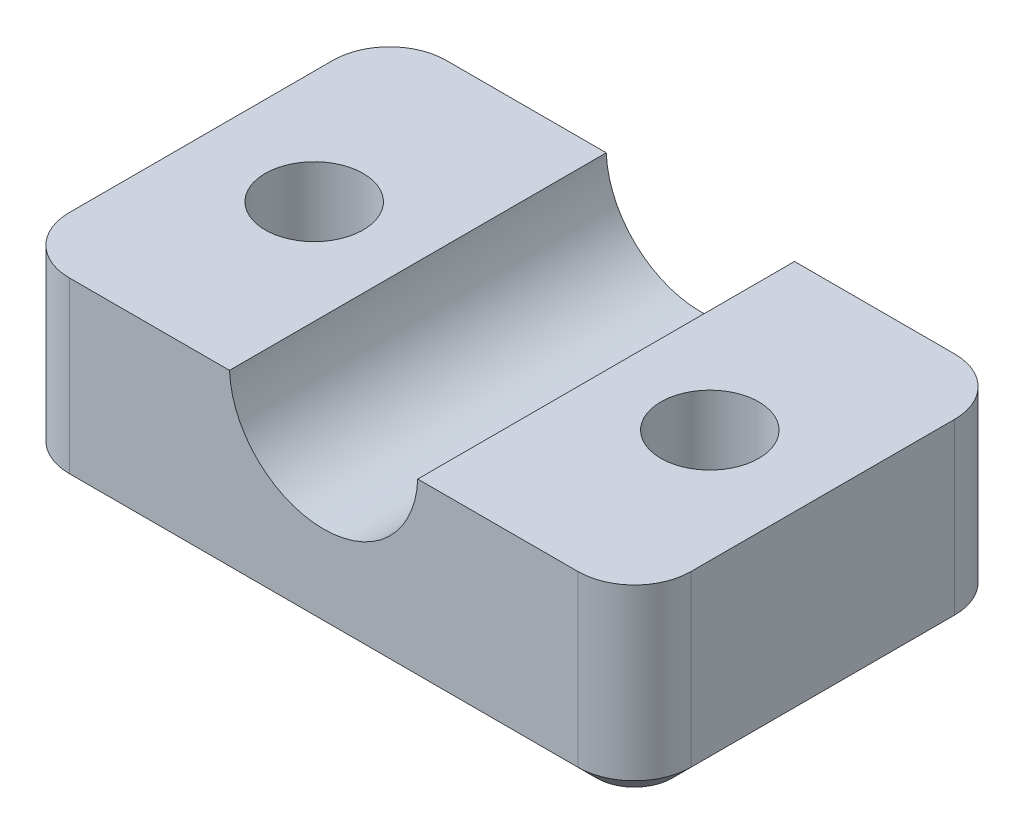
ISO-10303-21;
HEADER;
FILE_DESCRIPTION(('STEP AP214'),'2;1');
FILE_NAME('part.step','',(''),(''),'','','');
FILE_SCHEMA(('AUTOMOTIVE_DESIGN { 1 0 10303 214 1 1 1 1 }'));
ENDSEC;
DATA;
#1=APPLICATION_CONTEXT('core data for automotive mechanical design processes');
#2=APPLICATION_PROTOCOL_DEFINITION('international standard','automotive_design',2000,#1);
#3=PRODUCT_CONTEXT('',#1,'mechanical');
#4=PRODUCT('Part','Part','',(#3));
#5=PRODUCT_RELATED_PRODUCT_CATEGORY('part','',(#4));
#6=PRODUCT_DEFINITION_FORMATION('','',#4);
#7=PRODUCT_DEFINITION_CONTEXT('part definition',#1,'design');
#8=PRODUCT_DEFINITION('design','',#6,#7);
#9=PRODUCT_DEFINITION_SHAPE('','',#8);
#10=(LENGTH_UNIT() NAMED_UNIT(*) SI_UNIT(.MILLI.,.METRE.));
#11=(NAMED_UNIT(*) PLANE_ANGLE_UNIT() SI_UNIT($,.RADIAN.));
#12=(NAMED_UNIT(*) SI_UNIT($,.STERADIAN.) SOLID_ANGLE_UNIT());
#13=UNCERTAINTY_MEASURE_WITH_UNIT(LENGTH_MEASURE(1.E-05),#10,'distance_accuracy_value','');
#14=(GEOMETRIC_REPRESENTATION_CONTEXT(3) GLOBAL_UNCERTAINTY_ASSIGNED_CONTEXT((#13)) GLOBAL_UNIT_ASSIGNED_CONTEXT((#10,
#11,#12)) REPRESENTATION_CONTEXT('',''));
#15=CARTESIAN_POINT('',(0.,0.,0.));
#16=DIRECTION('',(0.,0.,1.));
#17=DIRECTION('',(1.,0.,0.));
#18=AXIS2_PLACEMENT_3D('',#15,#16,#17);
#19=CARTESIAN_POINT('',(-13.5,10.,7.));
#20=DIRECTION('',(0.,1.,0.));
#21=DIRECTION('',(0.,0.,1.));
#22=AXIS2_PLACEMENT_3D('',#19,#20,#21);
#23=PLANE('',#22);
#24=DIRECTION('',(0.,0.,-1.));
#25=VECTOR('',#24,1.);
#26=CARTESIAN_POINT('',(4.99599839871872,10.,24.142135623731));
#27=LINE('',#26,#25);
#28=CARTESIAN_POINT('',(4.99599839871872,10.,10.));
#29=VERTEX_POINT('',#28);
#30=CARTESIAN_POINT('',(4.99599839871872,10.,-10.));
#31=VERTEX_POINT('',#30);
#32=EDGE_CURVE('E146',#29,#31,#27,.T.);
#33=ORIENTED_EDGE('',*,*,#32,.F.);
#34=DIRECTION('',(1.,0.,0.));
#35=VECTOR('',#34,1.);
#36=CARTESIAN_POINT('',(-13.5,10.,10.));
#37=LINE('',#36,#35);
#38=CARTESIAN_POINT('',(13.5,10.,10.));
#39=VERTEX_POINT('',#38);
#40=EDGE_CURVE('E152',#29,#39,#37,.T.);
#41=ORIENTED_EDGE('',*,*,#40,.T.);
#42=CARTESIAN_POINT('',(13.5,10.,7.));
#43=DIRECTION('',(0.,1.,0.));
#44=DIRECTION('',(0.,0.,1.));
#45=AXIS2_PLACEMENT_3D('',#42,#43,#44);
#46=CIRCLE('',#45,3.);
#47=CARTESIAN_POINT('',(16.5,10.,7.));
#48=VERTEX_POINT('',#47);
#49=EDGE_CURVE('E159',#39,#48,#46,.T.);
#50=ORIENTED_EDGE('',*,*,#49,.T.);
#51=DIRECTION('',(0.,0.,-1.));
#52=VECTOR('',#51,1.);
#53=CARTESIAN_POINT('',(16.5,10.,7.));
#54=LINE('',#53,#52);
#55=CARTESIAN_POINT('',(16.5,10.,-7.));
#56=VERTEX_POINT('',#55);
#57=EDGE_CURVE('E161',#48,#56,#54,.T.);
#58=ORIENTED_EDGE('',*,*,#57,.T.);
#59=CARTESIAN_POINT('',(13.5,10.,-7.));
#60=DIRECTION('',(0.,1.,0.));
#61=DIRECTION('',(0.,0.,1.));
#62=AXIS2_PLACEMENT_3D('',#59,#60,#61);
#63=CIRCLE('',#62,3.);
#64=CARTESIAN_POINT('',(13.5,10.,-10.));
#65=VERTEX_POINT('',#64);
#66=EDGE_CURVE('E167',#56,#65,#63,.T.);
#67=ORIENTED_EDGE('',*,*,#66,.T.);
#68=DIRECTION('',(-1.,0.,0.));
#69=VECTOR('',#68,1.);
#70=CARTESIAN_POINT('',(-13.5,10.,-10.));
#71=LINE('',#70,#69);
#72=EDGE_CURVE('E170',#65,#31,#71,.T.);
#73=ORIENTED_EDGE('',*,*,#72,.T.);
#74=EDGE_LOOP('',(#33,#41,#50,#58,#67,#73));
#75=FACE_BOUND('',#74,.T.);
#76=CARTESIAN_POINT('',(10.5,10.,0.));
#77=DIRECTION('',(0.,1.,0.));
#78=DIRECTION('',(0.,0.,1.));
#79=AXIS2_PLACEMENT_3D('',#76,#77,#78);
#80=CIRCLE('',#79,2.6);
#81=CARTESIAN_POINT('',(10.5,10.,2.6));
#82=VERTEX_POINT('',#81);
#83=EDGE_CURVE('E263',#82,#82,#80,.T.);
#84=ORIENTED_EDGE('',*,*,#83,.F.);
#85=EDGE_LOOP('',(#84));
#86=FACE_BOUND('',#85,.T.);
#87=ADVANCED_FACE('F33',(#75,#86),#23,.T.);
#88=DIRECTION('',(0.,0.,-1.));
#89=VECTOR('',#88,1.);
#90=CARTESIAN_POINT('',(-4.99599839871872,10.,24.142135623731));
#91=LINE('',#90,#89);
#92=CARTESIAN_POINT('',(-4.99599839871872,10.,-10.));
#93=VERTEX_POINT('',#92);
#94=CARTESIAN_POINT('',(-4.99599839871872,10.,10.));
#95=VERTEX_POINT('',#94);
#96=EDGE_CURVE('E136',#93,#95,#91,.F.);
#97=ORIENTED_EDGE('',*,*,#96,.F.);
#98=CARTESIAN_POINT('',(-13.5,10.,-10.));
#99=VERTEX_POINT('',#98);
#100=EDGE_CURVE('E169',#93,#99,#71,.T.);
#101=ORIENTED_EDGE('',*,*,#100,.T.);
#102=CARTESIAN_POINT('',(-13.5,10.,-7.));
#103=DIRECTION('',(0.,1.,0.));
#104=DIRECTION('',(0.,0.,1.));
#105=AXIS2_PLACEMENT_3D('',#102,#103,#104);
#106=CIRCLE('',#105,3.);
#107=CARTESIAN_POINT('',(-16.5,10.,-7.));
#108=VERTEX_POINT('',#107);
#109=EDGE_CURVE('E173',#99,#108,#106,.T.);
#110=ORIENTED_EDGE('',*,*,#109,.T.);
#111=DIRECTION('',(0.,0.,1.));
#112=VECTOR('',#111,1.);
#113=CARTESIAN_POINT('',(-16.5,10.,7.));
#114=LINE('',#113,#112);
#115=CARTESIAN_POINT('',(-16.5,10.,7.));
#116=VERTEX_POINT('',#115);
#117=EDGE_CURVE('E175',#108,#116,#114,.T.);
#118=ORIENTED_EDGE('',*,*,#117,.T.);
#119=CARTESIAN_POINT('',(-13.5,10.,7.));
#120=DIRECTION('',(0.,1.,0.));
#121=DIRECTION('',(0.,0.,1.));
#122=AXIS2_PLACEMENT_3D('',#119,#120,#121);
#123=CIRCLE('',#122,3.);
#124=CARTESIAN_POINT('',(-13.5,10.,10.));
#125=VERTEX_POINT('',#124);
#126=EDGE_CURVE('E157',#116,#125,#123,.T.);
#127=ORIENTED_EDGE('',*,*,#126,.T.);
#128=EDGE_CURVE('E150',#125,#95,#37,.T.);
#129=ORIENTED_EDGE('',*,*,#128,.T.);
#130=EDGE_LOOP('',(#97,#101,#110,#118,#127,#129));
#131=FACE_BOUND('',#130,.T.);
#132=CARTESIAN_POINT('',(-10.5,10.,0.));
#133=DIRECTION('',(0.,1.,0.));
#134=DIRECTION('',(0.,0.,-1.));
#135=AXIS2_PLACEMENT_3D('',#132,#133,#134);
#136=CIRCLE('',#135,2.6);
#137=CARTESIAN_POINT('',(-10.5,10.,-2.6));
#138=VERTEX_POINT('',#137);
#139=EDGE_CURVE('E257',#138,#138,#136,.T.);
#140=ORIENTED_EDGE('',*,*,#139,.F.);
#141=EDGE_LOOP('',(#140));
#142=FACE_BOUND('',#141,.T.);
#143=ADVANCED_FACE('F154',(#131,#142),#23,.T.);
#144=CARTESIAN_POINT('',(-13.5,0.,7.));
#145=DIRECTION('',(0.,1.,0.));
#146=DIRECTION('',(0.,0.,1.));
#147=AXIS2_PLACEMENT_3D('',#144,#145,#146);
#148=PLANE('',#147);
#149=DIRECTION('',(0.,0.,-1.));
#150=VECTOR('',#149,1.);
#151=CARTESIAN_POINT('',(-15.5,0.,7.));
#152=LINE('',#151,#150);
#153=CARTESIAN_POINT('',(-15.5,0.,7.));
#154=VERTEX_POINT('',#153);
#155=CARTESIAN_POINT('',(-15.5,0.,-7.));
#156=VERTEX_POINT('',#155);
#157=EDGE_CURVE('E213',#154,#156,#152,.T.);
#158=ORIENTED_EDGE('',*,*,#157,.T.);
#159=CARTESIAN_POINT('',(-13.5,0.,-7.));
#160=DIRECTION('',(0.,1.,0.));
#161=DIRECTION('',(0.,0.,1.));
#162=AXIS2_PLACEMENT_3D('',#159,#160,#161);
#163=CIRCLE('',#162,2.);
#164=CARTESIAN_POINT('',(-13.5,0.,-9.));
#165=VERTEX_POINT('',#164);
#166=EDGE_CURVE('E215',#156,#165,#163,.F.);
#167=ORIENTED_EDGE('',*,*,#166,.T.);
#168=DIRECTION('',(1.,0.,0.));
#169=VECTOR('',#168,1.);
#170=CARTESIAN_POINT('',(-13.5,0.,-9.));
#171=LINE('',#170,#169);
#172=CARTESIAN_POINT('',(13.5,0.,-9.));
#173=VERTEX_POINT('',#172);
#174=EDGE_CURVE('E211',#165,#173,#171,.T.);
#175=ORIENTED_EDGE('',*,*,#174,.T.);
#176=CARTESIAN_POINT('',(13.5,0.,-7.));
#177=DIRECTION('',(0.,1.,0.));
#178=DIRECTION('',(0.,0.,1.));
#179=AXIS2_PLACEMENT_3D('',#176,#177,#178);
#180=CIRCLE('',#179,2.);
#181=CARTESIAN_POINT('',(15.5,0.,-7.));
#182=VERTEX_POINT('',#181);
#183=EDGE_CURVE('E207',#173,#182,#180,.F.);
#184=ORIENTED_EDGE('',*,*,#183,.T.);
#185=DIRECTION('',(0.,0.,1.));
#186=VECTOR('',#185,1.);
#187=CARTESIAN_POINT('',(15.5,0.,7.));
#188=LINE('',#187,#186);
#189=CARTESIAN_POINT('',(15.5,0.,7.));
#190=VERTEX_POINT('',#189);
#191=EDGE_CURVE('E203',#182,#190,#188,.T.);
#192=ORIENTED_EDGE('',*,*,#191,.T.);
#193=CARTESIAN_POINT('',(13.5,0.,7.));
#194=DIRECTION('',(0.,1.,0.));
#195=DIRECTION('',(0.,0.,1.));
#196=AXIS2_PLACEMENT_3D('',#193,#194,#195);
#197=CIRCLE('',#196,2.);
#198=CARTESIAN_POINT('',(13.5,0.,9.));
#199=VERTEX_POINT('',#198);
#200=EDGE_CURVE('E201',#190,#199,#197,.F.);
#201=ORIENTED_EDGE('',*,*,#200,.T.);
#202=DIRECTION('',(-1.,0.,0.));
#203=VECTOR('',#202,1.);
#204=CARTESIAN_POINT('',(-13.5,0.,9.));
#205=LINE('',#204,#203);
#206=CARTESIAN_POINT('',(-13.5,0.,9.));
#207=VERTEX_POINT('',#206);
#208=EDGE_CURVE('E205',#199,#207,#205,.T.);
#209=ORIENTED_EDGE('',*,*,#208,.T.);
#210=CARTESIAN_POINT('',(-13.5,0.,7.));
#211=DIRECTION('',(0.,1.,0.));
#212=DIRECTION('',(0.,0.,1.));
#213=AXIS2_PLACEMENT_3D('',#210,#211,#212);
#214=CIRCLE('',#213,2.);
#215=EDGE_CURVE('E209',#207,#154,#214,.F.);
#216=ORIENTED_EDGE('',*,*,#215,.T.);
#217=EDGE_LOOP('',(#158,#167,#175,#184,#192,#201,#209,#216));
#218=FACE_BOUND('',#217,.T.);
#219=CARTESIAN_POINT('',(10.5,0.,0.));
#220=DIRECTION('',(0.,1.,0.));
#221=DIRECTION('',(0.,0.,1.));
#222=AXIS2_PLACEMENT_3D('',#219,#220,#221);
#223=CIRCLE('',#222,2.6);
#224=CARTESIAN_POINT('',(10.5,0.,2.6));
#225=VERTEX_POINT('',#224);
#226=EDGE_CURVE('E260',#225,#225,#223,.T.);
#227=ORIENTED_EDGE('',*,*,#226,.T.);
#228=EDGE_LOOP('',(#227));
#229=FACE_BOUND('',#228,.T.);
#230=CARTESIAN_POINT('',(-10.5,0.,0.));
#231=DIRECTION('',(0.,1.,0.));
#232=DIRECTION('',(0.,0.,-1.));
#233=AXIS2_PLACEMENT_3D('',#230,#231,#232);
#234=CIRCLE('',#233,2.6);
#235=CARTESIAN_POINT('',(-10.5,0.,-2.6));
#236=VERTEX_POINT('',#235);
#237=EDGE_CURVE('E256',#236,#236,#234,.T.);
#238=ORIENTED_EDGE('',*,*,#237,.T.);
#239=EDGE_LOOP('',(#238));
#240=FACE_BOUND('',#239,.T.);
#241=ADVANCED_FACE('F268',(#218,#229,#240),#148,.F.);
#242=CARTESIAN_POINT('',(-13.5,10.,7.));
#243=DIRECTION('',(0.,-1.,0.));
#244=DIRECTION('',(0.,0.,-1.));
#245=AXIS2_PLACEMENT_3D('',#242,#243,#244);
#246=CYLINDRICAL_SURFACE('',#245,3.);
#247=DIRECTION('',(0.,-1.,0.));
#248=VECTOR('',#247,1.);
#249=CARTESIAN_POINT('',(-16.5,10.,7.));
#250=LINE('',#249,#248);
#251=CARTESIAN_POINT('',(-16.5,0.999999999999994,7.));
#252=VERTEX_POINT('',#251);
#253=EDGE_CURVE('E177',#116,#252,#250,.T.);
#254=ORIENTED_EDGE('',*,*,#253,.T.);
#255=CARTESIAN_POINT('',(-13.5,0.999999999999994,7.));
#256=DIRECTION('',(0.,1.,0.));
#257=DIRECTION('',(0.,0.,1.));
#258=AXIS2_PLACEMENT_3D('',#255,#256,#257);
#259=CIRCLE('',#258,3.);
#260=CARTESIAN_POINT('',(-13.5,0.999999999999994,10.));
#261=VERTEX_POINT('',#260);
#262=EDGE_CURVE('E222',#252,#261,#259,.T.);
#263=ORIENTED_EDGE('',*,*,#262,.T.);
#264=DIRECTION('',(0.,-1.,0.));
#265=VECTOR('',#264,1.);
#266=CARTESIAN_POINT('',(-13.5,10.,10.));
#267=LINE('',#266,#265);
#268=EDGE_CURVE('E196',#125,#261,#267,.T.);
#269=ORIENTED_EDGE('',*,*,#268,.F.);
#270=ORIENTED_EDGE('',*,*,#126,.F.);
#271=EDGE_LOOP('',(#254,#263,#269,#270));
#272=FACE_BOUND('',#271,.T.);
#273=ADVANCED_FACE('F295',(#272),#246,.T.);
#274=CARTESIAN_POINT('',(-13.5,10.,10.));
#275=DIRECTION('',(0.,0.,-1.));
#276=DIRECTION('',(-1.,0.,0.));
#277=AXIS2_PLACEMENT_3D('',#274,#275,#276);
#278=PLANE('',#277);
#279=ORIENTED_EDGE('',*,*,#268,.T.);
#280=DIRECTION('',(1.,0.,0.));
#281=VECTOR('',#280,1.);
#282=CARTESIAN_POINT('',(-13.5,0.999999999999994,10.));
#283=LINE('',#282,#281);
#284=CARTESIAN_POINT('',(13.5,0.999999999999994,10.));
#285=VERTEX_POINT('',#284);
#286=EDGE_CURVE('E56',#261,#285,#283,.T.);
#287=ORIENTED_EDGE('',*,*,#286,.T.);
#288=DIRECTION('',(0.,-1.,0.));
#289=VECTOR('',#288,1.);
#290=CARTESIAN_POINT('',(13.5,10.,10.));
#291=LINE('',#290,#289);
#292=EDGE_CURVE('E194',#39,#285,#291,.T.);
#293=ORIENTED_EDGE('',*,*,#292,.F.);
#294=ORIENTED_EDGE('',*,*,#40,.F.);
#295=CARTESIAN_POINT('',(0.,10.2,10.));
#296=DIRECTION('',(0.,0.,-1.));
#297=DIRECTION('',(-1.,0.,0.));
#298=AXIS2_PLACEMENT_3D('',#295,#296,#297);
#299=CIRCLE('',#298,5.);
#300=EDGE_CURVE('E139',#95,#29,#299,.F.);
#301=ORIENTED_EDGE('',*,*,#300,.F.);
#302=ORIENTED_EDGE('',*,*,#128,.F.);
#303=EDGE_LOOP('',(#279,#287,#293,#294,#301,#302));
#304=FACE_BOUND('',#303,.T.);
#305=ADVANCED_FACE('F149',(#304),#278,.F.);
#306=CARTESIAN_POINT('',(13.5,10.,7.));
#307=DIRECTION('',(0.,-1.,0.));
#308=DIRECTION('',(0.,0.,-1.));
#309=AXIS2_PLACEMENT_3D('',#306,#307,#308);
#310=CYLINDRICAL_SURFACE('',#309,3.);
#311=ORIENTED_EDGE('',*,*,#292,.T.);
#312=CARTESIAN_POINT('',(13.5,0.999999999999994,7.));
#313=DIRECTION('',(0.,1.,0.));
#314=DIRECTION('',(0.,0.,1.));
#315=AXIS2_PLACEMENT_3D('',#312,#313,#314);
#316=CIRCLE('',#315,3.);
#317=CARTESIAN_POINT('',(16.5,0.999999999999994,7.));
#318=VERTEX_POINT('',#317);
#319=EDGE_CURVE('E11',#285,#318,#316,.T.);
#320=ORIENTED_EDGE('',*,*,#319,.T.);
#321=DIRECTION('',(0.,-1.,0.));
#322=VECTOR('',#321,1.);
#323=CARTESIAN_POINT('',(16.5,10.,7.));
#324=LINE('',#323,#322);
#325=EDGE_CURVE('E192',#48,#318,#324,.T.);
#326=ORIENTED_EDGE('',*,*,#325,.F.);
#327=ORIENTED_EDGE('',*,*,#49,.F.);
#328=EDGE_LOOP('',(#311,#320,#326,#327));
#329=FACE_BOUND('',#328,.T.);
#330=ADVANCED_FACE('F312',(#329),#310,.T.);
#331=CARTESIAN_POINT('',(16.5,10.,7.));
#332=DIRECTION('',(-1.,0.,0.));
#333=DIRECTION('',(0.,0.,1.));
#334=AXIS2_PLACEMENT_3D('',#331,#332,#333);
#335=PLANE('',#334);
#336=ORIENTED_EDGE('',*,*,#325,.T.);
#337=DIRECTION('',(0.,0.,-1.));
#338=VECTOR('',#337,1.);
#339=CARTESIAN_POINT('',(16.5,0.999999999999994,7.));
#340=LINE('',#339,#338);
#341=CARTESIAN_POINT('',(16.5,0.999999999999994,-7.));
#342=VERTEX_POINT('',#341);
#343=EDGE_CURVE('E42',#318,#342,#340,.T.);
#344=ORIENTED_EDGE('',*,*,#343,.T.);
#345=DIRECTION('',(0.,-1.,0.));
#346=VECTOR('',#345,1.);
#347=CARTESIAN_POINT('',(16.5,10.,-7.));
#348=LINE('',#347,#346);
#349=EDGE_CURVE('E189',#56,#342,#348,.T.);
#350=ORIENTED_EDGE('',*,*,#349,.F.);
#351=ORIENTED_EDGE('',*,*,#57,.F.);
#352=EDGE_LOOP('',(#336,#344,#350,#351));
#353=FACE_BOUND('',#352,.T.);
#354=ADVANCED_FACE('F308',(#353),#335,.F.);
#355=CARTESIAN_POINT('',(13.5,10.,-7.));
#356=DIRECTION('',(0.,-1.,0.));
#357=DIRECTION('',(0.,0.,-1.));
#358=AXIS2_PLACEMENT_3D('',#355,#356,#357);
#359=CYLINDRICAL_SURFACE('',#358,3.);
#360=ORIENTED_EDGE('',*,*,#349,.T.);
#361=CARTESIAN_POINT('',(13.5,0.999999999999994,-7.));
#362=DIRECTION('',(0.,1.,0.));
#363=DIRECTION('',(0.,0.,1.));
#364=AXIS2_PLACEMENT_3D('',#361,#362,#363);
#365=CIRCLE('',#364,3.);
#366=CARTESIAN_POINT('',(13.5,0.999999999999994,-10.));
#367=VERTEX_POINT('',#366);
#368=EDGE_CURVE('E224',#342,#367,#365,.T.);
#369=ORIENTED_EDGE('',*,*,#368,.T.);
#370=DIRECTION('',(0.,-1.,0.));
#371=VECTOR('',#370,1.);
#372=CARTESIAN_POINT('',(13.5,10.,-10.));
#373=LINE('',#372,#371);
#374=EDGE_CURVE('E186',#65,#367,#373,.T.);
#375=ORIENTED_EDGE('',*,*,#374,.F.);
#376=ORIENTED_EDGE('',*,*,#66,.F.);
#377=EDGE_LOOP('',(#360,#369,#375,#376));
#378=FACE_BOUND('',#377,.T.);
#379=ADVANCED_FACE('F304',(#378),#359,.T.);
#380=CARTESIAN_POINT('',(-13.5,10.,-10.));
#381=DIRECTION('',(0.,0.,1.));
#382=DIRECTION('',(1.,0.,0.));
#383=AXIS2_PLACEMENT_3D('',#380,#381,#382);
#384=PLANE('',#383);
#385=ORIENTED_EDGE('',*,*,#374,.T.);
#386=DIRECTION('',(-1.,0.,0.));
#387=VECTOR('',#386,1.);
#388=CARTESIAN_POINT('',(-13.5,0.999999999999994,-10.));
#389=LINE('',#388,#387);
#390=CARTESIAN_POINT('',(-13.5,0.999999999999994,-10.));
#391=VERTEX_POINT('',#390);
#392=EDGE_CURVE('E220',#367,#391,#389,.T.);
#393=ORIENTED_EDGE('',*,*,#392,.T.);
#394=DIRECTION('',(0.,-1.,0.));
#395=VECTOR('',#394,1.);
#396=CARTESIAN_POINT('',(-13.5,10.,-10.));
#397=LINE('',#396,#395);
#398=EDGE_CURVE('E183',#99,#391,#397,.T.);
#399=ORIENTED_EDGE('',*,*,#398,.F.);
#400=ORIENTED_EDGE('',*,*,#100,.F.);
#401=CARTESIAN_POINT('',(0.,10.2,-10.));
#402=DIRECTION('',(0.,0.,-1.));
#403=DIRECTION('',(-1.,0.,0.));
#404=AXIS2_PLACEMENT_3D('',#401,#402,#403);
#405=CIRCLE('',#404,5.);
#406=EDGE_CURVE('E142',#31,#93,#405,.T.);
#407=ORIENTED_EDGE('',*,*,#406,.F.);
#408=ORIENTED_EDGE('',*,*,#72,.F.);
#409=EDGE_LOOP('',(#385,#393,#399,#400,#407,#408));
#410=FACE_BOUND('',#409,.T.);
#411=ADVANCED_FACE('F300',(#410),#384,.F.);
#412=CARTESIAN_POINT('',(-13.5,10.,-7.));
#413=DIRECTION('',(0.,-1.,0.));
#414=DIRECTION('',(0.,0.,-1.));
#415=AXIS2_PLACEMENT_3D('',#412,#413,#414);
#416=CYLINDRICAL_SURFACE('',#415,3.);
#417=ORIENTED_EDGE('',*,*,#398,.T.);
#418=CARTESIAN_POINT('',(-13.5,0.999999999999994,-7.));
#419=DIRECTION('',(0.,1.,0.));
#420=DIRECTION('',(0.,0.,1.));
#421=AXIS2_PLACEMENT_3D('',#418,#419,#420);
#422=CIRCLE('',#421,3.);
#423=CARTESIAN_POINT('',(-16.5,0.999999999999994,-7.));
#424=VERTEX_POINT('',#423);
#425=EDGE_CURVE('E198',#391,#424,#422,.T.);
#426=ORIENTED_EDGE('',*,*,#425,.T.);
#427=DIRECTION('',(0.,-1.,0.));
#428=VECTOR('',#427,1.);
#429=CARTESIAN_POINT('',(-16.5,10.,-7.));
#430=LINE('',#429,#428);
#431=EDGE_CURVE('E180',#108,#424,#430,.T.);
#432=ORIENTED_EDGE('',*,*,#431,.F.);
#433=ORIENTED_EDGE('',*,*,#109,.F.);
#434=EDGE_LOOP('',(#417,#426,#432,#433));
#435=FACE_BOUND('',#434,.T.);
#436=ADVANCED_FACE('F283',(#435),#416,.T.);
#437=CARTESIAN_POINT('',(-16.5,10.,7.));
#438=DIRECTION('',(1.,0.,0.));
#439=DIRECTION('',(0.,0.,-1.));
#440=AXIS2_PLACEMENT_3D('',#437,#438,#439);
#441=PLANE('',#440);
#442=ORIENTED_EDGE('',*,*,#431,.T.);
#443=DIRECTION('',(0.,0.,1.));
#444=VECTOR('',#443,1.);
#445=CARTESIAN_POINT('',(-16.5,0.999999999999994,7.));
#446=LINE('',#445,#444);
#447=EDGE_CURVE('E218',#424,#252,#446,.T.);
#448=ORIENTED_EDGE('',*,*,#447,.T.);
#449=ORIENTED_EDGE('',*,*,#253,.F.);
#450=ORIENTED_EDGE('',*,*,#117,.F.);
#451=EDGE_LOOP('',(#442,#448,#449,#450));
#452=FACE_BOUND('',#451,.T.);
#453=ADVANCED_FACE('F274',(#452),#441,.F.);
#454=CARTESIAN_POINT('',(10.5,10.,0.));
#455=DIRECTION('',(0.,-1.,0.));
#456=DIRECTION('',(0.,0.,-1.));
#457=AXIS2_PLACEMENT_3D('',#454,#455,#456);
#458=CYLINDRICAL_SURFACE('',#457,2.6);
#459=ORIENTED_EDGE('',*,*,#83,.T.);
#460=EDGE_LOOP('',(#459));
#461=FACE_BOUND('',#460,.T.);
#462=ORIENTED_EDGE('',*,*,#226,.F.);
#463=EDGE_LOOP('',(#462));
#464=FACE_BOUND('',#463,.T.);
#465=ADVANCED_FACE('F271',(#461,#464),#458,.F.);
#466=CARTESIAN_POINT('',(-10.5,10.,0.));
#467=DIRECTION('',(0.,-1.,0.));
#468=DIRECTION('',(0.,0.,-1.));
#469=AXIS2_PLACEMENT_3D('',#466,#467,#468);
#470=CYLINDRICAL_SURFACE('',#469,2.6);
#471=ORIENTED_EDGE('',*,*,#139,.T.);
#472=EDGE_LOOP('',(#471));
#473=FACE_BOUND('',#472,.T.);
#474=ORIENTED_EDGE('',*,*,#237,.F.);
#475=EDGE_LOOP('',(#474));
#476=FACE_BOUND('',#475,.T.);
#477=ADVANCED_FACE('F273',(#473,#476),#470,.F.);
#478=CARTESIAN_POINT('',(0.,10.2,24.142135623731));
#479=DIRECTION('',(0.,0.,-1.));
#480=DIRECTION('',(-1.,0.,0.));
#481=AXIS2_PLACEMENT_3D('',#478,#479,#480);
#482=CYLINDRICAL_SURFACE('',#481,5.);
#483=ORIENTED_EDGE('',*,*,#32,.T.);
#484=ORIENTED_EDGE('',*,*,#406,.T.);
#485=ORIENTED_EDGE('',*,*,#96,.T.);
#486=ORIENTED_EDGE('',*,*,#300,.T.);
#487=EDGE_LOOP('',(#483,#484,#485,#486));
#488=FACE_BOUND('',#487,.T.);
#489=ADVANCED_FACE('F138',(#488),#482,.F.);
#490=CARTESIAN_POINT('',(13.5,0.999999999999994,7.));
#491=DIRECTION('',(0.,1.,0.));
#492=DIRECTION('',(0.,0.,1.));
#493=AXIS2_PLACEMENT_3D('',#490,#491,#492);
#494=CONICAL_SURFACE('',#493,3.,0.785398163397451);
#495=DIRECTION('',(0.,0.707106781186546,0.707106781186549));
#496=VECTOR('',#495,1.);
#497=CARTESIAN_POINT('',(13.5,0.,9.));
#498=LINE('',#497,#496);
#499=EDGE_CURVE('E243',#199,#285,#498,.T.);
#500=ORIENTED_EDGE('',*,*,#499,.F.);
#501=ORIENTED_EDGE('',*,*,#200,.F.);
#502=DIRECTION('',(-0.707106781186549,-0.707106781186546,0.));
#503=VECTOR('',#502,1.);
#504=CARTESIAN_POINT('',(16.5,0.999999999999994,7.));
#505=LINE('',#504,#503);
#506=EDGE_CURVE('E37',#318,#190,#505,.T.);
#507=ORIENTED_EDGE('',*,*,#506,.F.);
#508=ORIENTED_EDGE('',*,*,#319,.F.);
#509=EDGE_LOOP('',(#500,#501,#507,#508));
#510=FACE_BOUND('',#509,.T.);
#511=ADVANCED_FACE('F35',(#510),#494,.T.);
#512=CARTESIAN_POINT('',(16.5,0.999999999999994,7.));
#513=DIRECTION('',(-0.707106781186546,0.707106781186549,0.));
#514=DIRECTION('',(0.,0.,-1.));
#515=AXIS2_PLACEMENT_3D('',#512,#513,#514);
#516=PLANE('',#515);
#517=ORIENTED_EDGE('',*,*,#506,.T.);
#518=ORIENTED_EDGE('',*,*,#191,.F.);
#519=DIRECTION('',(-0.707106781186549,-0.707106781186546,0.));
#520=VECTOR('',#519,1.);
#521=CARTESIAN_POINT('',(16.5,0.999999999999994,-7.));
#522=LINE('',#521,#520);
#523=EDGE_CURVE('E241',#342,#182,#522,.T.);
#524=ORIENTED_EDGE('',*,*,#523,.F.);
#525=ORIENTED_EDGE('',*,*,#343,.F.);
#526=EDGE_LOOP('',(#517,#518,#524,#525));
#527=FACE_BOUND('',#526,.T.);
#528=ADVANCED_FACE('F343',(#527),#516,.F.);
#529=CARTESIAN_POINT('',(-13.5,0.999999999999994,10.));
#530=DIRECTION('',(0.,0.707106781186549,-0.707106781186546));
#531=DIRECTION('',(1.,0.,0.));
#532=AXIS2_PLACEMENT_3D('',#529,#530,#531);
#533=PLANE('',#532);
#534=ORIENTED_EDGE('',*,*,#499,.T.);
#535=ORIENTED_EDGE('',*,*,#286,.F.);
#536=DIRECTION('',(0.,0.707106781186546,0.707106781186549));
#537=VECTOR('',#536,1.);
#538=CARTESIAN_POINT('',(-13.5,0.,9.));
#539=LINE('',#538,#537);
#540=EDGE_CURVE('E238',#207,#261,#539,.T.);
#541=ORIENTED_EDGE('',*,*,#540,.F.);
#542=ORIENTED_EDGE('',*,*,#208,.F.);
#543=EDGE_LOOP('',(#534,#535,#541,#542));
#544=FACE_BOUND('',#543,.T.);
#545=ADVANCED_FACE('F340',(#544),#533,.F.);
#546=CARTESIAN_POINT('',(13.5,0.999999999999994,-7.));
#547=DIRECTION('',(0.,1.,0.));
#548=DIRECTION('',(0.,0.,1.));
#549=AXIS2_PLACEMENT_3D('',#546,#547,#548);
#550=CONICAL_SURFACE('',#549,3.,0.785398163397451);
#551=ORIENTED_EDGE('',*,*,#523,.T.);
#552=ORIENTED_EDGE('',*,*,#183,.F.);
#553=DIRECTION('',(0.,-0.707106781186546,0.707106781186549));
#554=VECTOR('',#553,1.);
#555=CARTESIAN_POINT('',(13.5,0.999999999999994,-10.));
#556=LINE('',#555,#554);
#557=EDGE_CURVE('E235',#367,#173,#556,.T.);
#558=ORIENTED_EDGE('',*,*,#557,.F.);
#559=ORIENTED_EDGE('',*,*,#368,.F.);
#560=EDGE_LOOP('',(#551,#552,#558,#559));
#561=FACE_BOUND('',#560,.T.);
#562=ADVANCED_FACE('F336',(#561),#550,.T.);
#563=CARTESIAN_POINT('',(-13.5,0.999999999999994,7.));
#564=DIRECTION('',(0.,1.,0.));
#565=DIRECTION('',(0.,0.,1.));
#566=AXIS2_PLACEMENT_3D('',#563,#564,#565);
#567=CONICAL_SURFACE('',#566,3.,0.785398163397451);
#568=ORIENTED_EDGE('',*,*,#540,.T.);
#569=ORIENTED_EDGE('',*,*,#262,.F.);
#570=DIRECTION('',(-0.707106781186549,0.707106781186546,0.));
#571=VECTOR('',#570,1.);
#572=CARTESIAN_POINT('',(-15.5,0.,7.));
#573=LINE('',#572,#571);
#574=EDGE_CURVE('E232',#154,#252,#573,.T.);
#575=ORIENTED_EDGE('',*,*,#574,.F.);
#576=ORIENTED_EDGE('',*,*,#215,.F.);
#577=EDGE_LOOP('',(#568,#569,#575,#576));
#578=FACE_BOUND('',#577,.T.);
#579=ADVANCED_FACE('F332',(#578),#567,.T.);
#580=CARTESIAN_POINT('',(-13.5,0.999999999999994,-10.));
#581=DIRECTION('',(0.,0.707106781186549,0.707106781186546));
#582=DIRECTION('',(-1.,0.,0.));
#583=AXIS2_PLACEMENT_3D('',#580,#581,#582);
#584=PLANE('',#583);
#585=ORIENTED_EDGE('',*,*,#557,.T.);
#586=ORIENTED_EDGE('',*,*,#174,.F.);
#587=DIRECTION('',(0.,-0.707106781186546,0.707106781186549));
#588=VECTOR('',#587,1.);
#589=CARTESIAN_POINT('',(-13.5,0.999999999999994,-10.));
#590=LINE('',#589,#588);
#591=EDGE_CURVE('E230',#391,#165,#590,.T.);
#592=ORIENTED_EDGE('',*,*,#591,.F.);
#593=ORIENTED_EDGE('',*,*,#392,.F.);
#594=EDGE_LOOP('',(#585,#586,#592,#593));
#595=FACE_BOUND('',#594,.T.);
#596=ADVANCED_FACE('F328',(#595),#584,.F.);
#597=CARTESIAN_POINT('',(-16.5,0.999999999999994,7.));
#598=DIRECTION('',(0.707106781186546,0.707106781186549,0.));
#599=DIRECTION('',(0.,0.,1.));
#600=AXIS2_PLACEMENT_3D('',#597,#598,#599);
#601=PLANE('',#600);
#602=ORIENTED_EDGE('',*,*,#574,.T.);
#603=ORIENTED_EDGE('',*,*,#447,.F.);
#604=DIRECTION('',(-0.707106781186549,0.707106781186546,0.));
#605=VECTOR('',#604,1.);
#606=CARTESIAN_POINT('',(-15.5,0.,-7.));
#607=LINE('',#606,#605);
#608=EDGE_CURVE('E228',#156,#424,#607,.T.);
#609=ORIENTED_EDGE('',*,*,#608,.F.);
#610=ORIENTED_EDGE('',*,*,#157,.F.);
#611=EDGE_LOOP('',(#602,#603,#609,#610));
#612=FACE_BOUND('',#611,.T.);
#613=ADVANCED_FACE('F324',(#612),#601,.F.);
#614=CARTESIAN_POINT('',(-13.5,0.999999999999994,-7.));
#615=DIRECTION('',(0.,1.,0.));
#616=DIRECTION('',(0.,0.,1.));
#617=AXIS2_PLACEMENT_3D('',#614,#615,#616);
#618=CONICAL_SURFACE('',#617,3.,0.785398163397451);
#619=ORIENTED_EDGE('',*,*,#591,.T.);
#620=ORIENTED_EDGE('',*,*,#166,.F.);
#621=ORIENTED_EDGE('',*,*,#608,.T.);
#622=ORIENTED_EDGE('',*,*,#425,.F.);
#623=EDGE_LOOP('',(#619,#620,#621,#622));
#624=FACE_BOUND('',#623,.T.);
#625=ADVANCED_FACE('F321',(#624),#618,.T.);
#626=CLOSED_SHELL('',(#87,#143,#241,#273,#305,#330,#354,#379,#411,#436,#453,#465,#477,#489,#511,
#528,#545,#562,#579,#596,#613,#625));
#627=MANIFOLD_SOLID_BREP('B2',#626);
#628=ADVANCED_BREP_SHAPE_REPRESENTATION('',(#18,#627),#14);
#629=SHAPE_DEFINITION_REPRESENTATION(#9,#628);
ENDSEC;
END-ISO-10303-21;
